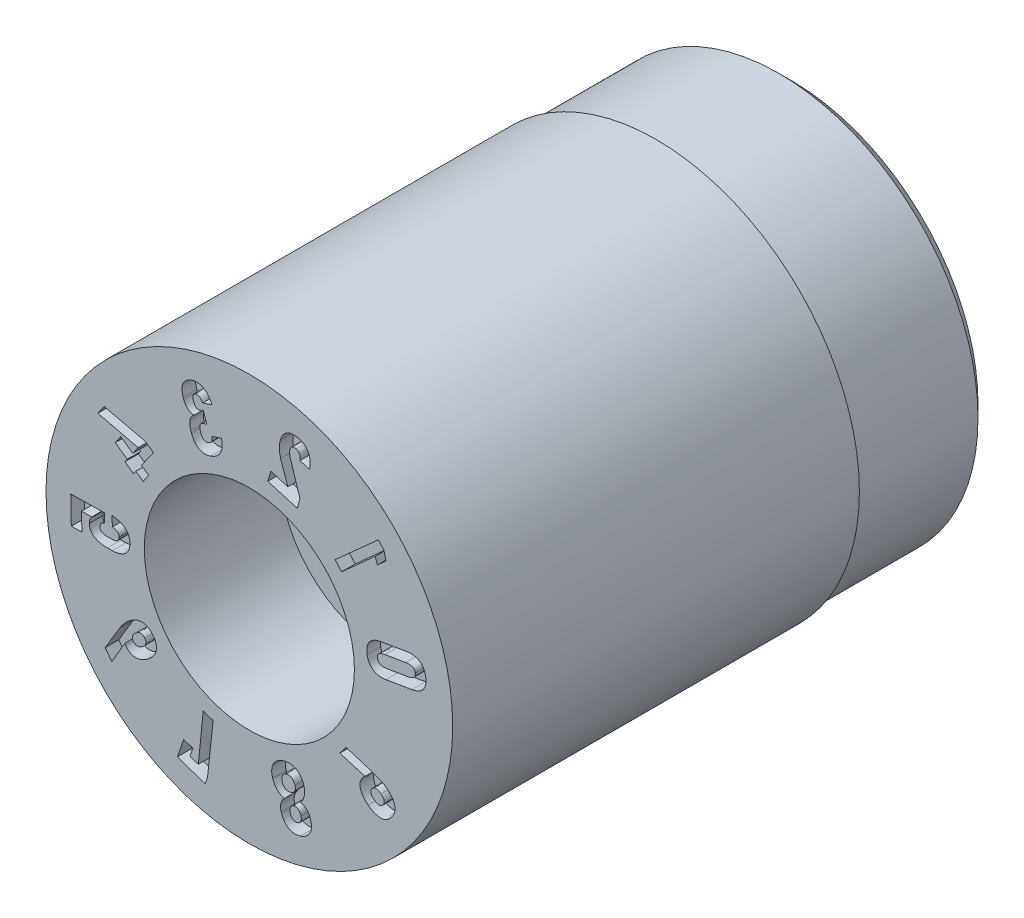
from build123d import *

# Parameters (mm, degrees)
SKETCH4_W          = 2
SKETCH4_H          = 1
CUT_EXTRUDE1_DEPTH = 0.2


with BuildPart() as part:
    # Sketch1 → Revolve1 (revolve)
    with BuildSketch(Plane(origin=(0, 0, 0), x_dir=(0, 0, -1), z_dir=(1, 0, 0)), mode=Mode.PRIVATE) as revolve1_sk:
        Polygon((0, 3), (0, 1.55), (2, 1.55), (2, 0.8), (8, 0.8), (8, 2.75), (7.75, 3), align=None)
    revolve(revolve1_sk.sketch.rotate(Axis((0, 0, 3.797909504), (0, 0, -1)), 90), axis=Axis((0, 0, 3.797909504), (0, 0, -1)))

    # Sketch4 → Cut-Revolve1 (revolve, cut)
    with BuildSketch(Plane(origin=(0, 0, 0), x_dir=(0, 0, -1), z_dir=(1, 0, 0)), mode=Mode.PRIVATE) as cut_revolve1_sk:
        with Locations((7, 3.435)):
            Rectangle(SKETCH4_W, SKETCH4_H)
    revolve(cut_revolve1_sk.sketch.rotate(Axis((0, 0, 0), (0, 0, -1)), 90), axis=Axis((0, 0, 0), (0, 0, -1)), mode=Mode.SUBTRACT)

    # Sketch6 → Cut-Extrude1 (cut)
    # profile 1 of 10: a face of its own
    with BuildSketch(Plane.XY):
        with BuildLine():
            Line((2.014607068, 0.10551883), (2.398508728, 0.169344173))
            add(Edge.make_bspline(
                [(2.398508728, 0.169344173), (2.416406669, 0.172558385), (2.442569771, 0.178085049), (2.475088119, 0.190085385), (2.496970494, 0.200173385), (2.517140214, 0.211589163), (2.535204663, 0.22497844), (2.55164404, 0.239607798), (2.565913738, 0.255949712), (2.578395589, 0.273514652), (2.588310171, 0.292630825), (2.596175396, 0.3129478), (2.601711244, 0.334577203), (2.604982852, 0.357519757), (2.606209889, 0.390669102), (2.603953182, 0.41610249), (2.601027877, 0.433275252)],
                knots=[0, 0, 0, 0, 0.144216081, 0.210853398, 0.274107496, 0.334900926, 0.394019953, 0.451854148, 0.508838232, 0.565473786, 0.62209422, 0.678903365, 0.737673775, 0.798507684, 0.862085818, 1, 1, 1, 1], degree=3))
            add(Edge.make_bspline(
                [(2.601027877, 0.433275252), (2.598176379, 0.450529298), (2.592326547, 0.475467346), (2.580262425, 0.506439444), (2.569649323, 0.526996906), (2.557505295, 0.545788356), (2.543571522, 0.562619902), (2.527858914, 0.577341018), (2.510620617, 0.590095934), (2.491837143, 0.600725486), (2.471733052, 0.609473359), (2.450249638, 0.61603244), (2.427474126, 0.620479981), (2.403380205, 0.622713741), (2.368557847, 0.623256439), (2.341871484, 0.620188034), (2.323795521, 0.617328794)],
                knots=[0, 0, 0, 0, 0.138368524, 0.201729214, 0.262433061, 0.321041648, 0.378364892, 0.434789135, 0.490925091, 0.547560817, 0.605121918, 0.663992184, 0.724855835, 0.788332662, 0.855124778, 1, 1, 1, 1], degree=3))
            Line((2.323795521, 0.617328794), (1.93989386, 0.55350345))
            add(Edge.make_bspline(
                [(1.93989386, 0.55350345), (1.921922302, 0.550550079), (1.895959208, 0.544372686), (1.863299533, 0.532813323), (1.841394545, 0.522709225), (1.821358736, 0.511050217), (1.803243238, 0.497718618), (1.786832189, 0.483061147), (1.772468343, 0.466742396), (1.760249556, 0.449010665), (1.750036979, 0.430014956), (1.742366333, 0.409631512), (1.73702506, 0.388004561), (1.733662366, 0.365150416), (1.73204775, 0.332049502), (1.734920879, 0.306627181), (1.737597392, 0.289463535)],
                knots=[0, 0, 0, 0, 0.144224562, 0.21087119, 0.274141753, 0.33504075, 0.394175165, 0.452024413, 0.509023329, 0.565947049, 0.622265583, 0.679444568, 0.73797653, 0.798414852, 0.862179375, 1, 1, 1, 1], degree=3))
            add(Edge.make_bspline(
                [(1.737597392, 0.289463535), (1.740446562, 0.272209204), (1.746316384, 0.2472149), (1.758401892, 0.216190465), (1.769005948, 0.19554525), (1.781295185, 0.176852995), (1.795472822, 0.160272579), (1.811078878, 0.145380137), (1.828688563, 0.132938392), (1.847612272, 0.122283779), (1.867893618, 0.113597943), (1.889453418, 0.107180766), (1.912137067, 0.102583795), (1.936072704, 0.100308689), (1.970485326, 0.099711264), (1.996840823, 0.102547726), (2.014607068, 0.10551883)],
                knots=[0, 0, 0, 0, 0.138608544, 0.202541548, 0.263350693, 0.322175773, 0.37933296, 0.435855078, 0.492619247, 0.549660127, 0.60766372, 0.667010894, 0.727580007, 0.790746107, 0.857218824, 1, 1, 1, 1], degree=3))
        make_face()
        with BuildLine():
            Line((2.004180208, 0.41918152), (2.306729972, 0.469524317))
            add(Edge.make_bspline(
                [(2.306729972, 0.469524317), (2.324922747, 0.472611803), (2.351137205, 0.474893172), (2.384042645, 0.471767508), (2.401145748, 0.46692035), (2.412983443, 0.461443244), (2.420708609, 0.456379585), (2.427625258, 0.450495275), (2.433693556, 0.443754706), (2.438541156, 0.435943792), (2.44407935, 0.424247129), (2.44675796, 0.414618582), (2.447787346, 0.40789211)],
                knots=[0, 0, 0, 0, 0.317749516, 0.449992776, 0.566883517, 0.621635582, 0.673931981, 0.725321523, 0.777608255, 0.829311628, 0.882944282, 1, 1, 1, 1], degree=3))
            add(Edge.make_bspline(
                [(2.447787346, 0.40789211), (2.44974033, 0.395304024), (2.449970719, 0.375425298), (2.438235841, 0.352785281), (2.425330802, 0.338609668), (2.408184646, 0.326774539), (2.378206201, 0.312860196), (2.352634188, 0.306551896), (2.33438814, 0.303723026)],
                knots=[0, 0, 0, 0, 0.222795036, 0.325269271, 0.432490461, 0.549985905, 0.681672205, 1, 1, 1, 1], degree=3))
            Line((2.33438814, 0.303723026), (2.031838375, 0.253380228))
            add(Edge.make_bspline(
                [(2.031838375, 0.253380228), (2.013674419, 0.250051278), (1.98749062, 0.247906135), (1.954530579, 0.250912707), (1.937461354, 0.255993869), (1.92558179, 0.261455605), (1.917867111, 0.266532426), (1.910975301, 0.272335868), (1.905032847, 0.279163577), (1.900225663, 0.286969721), (1.894648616, 0.298711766), (1.891979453, 0.30834427), (1.89094676, 0.315069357)],
                knots=[0, 0, 0, 0, 0.317529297, 0.44976705, 0.567235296, 0.621985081, 0.674279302, 0.725666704, 0.776639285, 0.829318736, 0.882949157, 1, 1, 1, 1], degree=3))
            add(Edge.make_bspline(
                [(1.89094676, 0.315069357), (1.888938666, 0.327685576), (1.888861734, 0.347442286), (1.900316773, 0.370172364), (1.913250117, 0.384290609), (1.930382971, 0.396121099), (1.960336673, 0.410114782), (1.986045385, 0.41594957), (2.004180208, 0.41918152)],
                knots=[0, 0, 0, 0, 0.222979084, 0.324818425, 0.43212819, 0.549720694, 0.681515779, 1, 1, 1, 1], degree=3))
        make_face(mode=Mode.SUBTRACT)
    # profile 2 of 10: a face of its own
    with BuildSketch(Plane.XY):
        Polygon((1.265939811, 1.262895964), (1.361685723, 1.156386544), (1.857198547, 1.602072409), (1.889825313, 1.50691542), (2.017030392, 1.621417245), (1.984045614, 1.744462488), (1.902313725, 1.835367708), align=None)
    # profile 3 of 10: a face of its own
    with BuildSketch(Plane.XY):
        with BuildLine():
            Line((0.747077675, 1.782271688), (0.60452419, 2.229378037))
            add(Edge.make_bspline(
                [(0.60452419, 2.229378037), (0.598029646, 2.248428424), (0.590905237, 2.285672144), (0.593293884, 2.323589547), (0.598117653, 2.340536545)],
                knots=[0, 0, 0, 0, 0.5342471, 1, 1, 1, 1], degree=3))
            Line((0.598117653, 2.340536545), (0.598482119, 2.341759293))
            add(Edge.make_bspline(
                [(0.598482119, 2.341759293), (0.60115539, 2.351892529), (0.607672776, 2.365898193), (0.620928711, 2.380666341), (0.632532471, 2.388409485), (0.645672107, 2.39330472), (0.666001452, 2.39637324), (0.681866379, 2.393018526), (0.692366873, 2.390166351)],
                knots=[0, 0, 0, 0, 0.261266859, 0.378258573, 0.491228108, 0.605842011, 0.725733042, 1, 1, 1, 1], degree=3))
            add(Edge.make_bspline(
                [(0.692366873, 2.390166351), (0.703130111, 2.387360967), (0.718026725, 2.379575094), (0.733062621, 2.363344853), (0.741143, 2.348590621), (0.746448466, 2.33159353), (0.750026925, 2.304874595), (0.747817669, 2.283751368), (0.745202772, 2.269338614)],
                knots=[0, 0, 0, 0, 0.227548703, 0.335372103, 0.449552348, 0.569520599, 0.698702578, 1, 1, 1, 1], degree=3))
            Line((0.745202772, 2.269338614), (0.886598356, 2.227343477))
            add(Edge.make_bspline(
                [(0.886598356, 2.227343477), (0.892329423, 2.252723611), (0.898144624, 2.289418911), (0.897616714, 2.337570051), (0.893400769, 2.370675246), (0.885645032, 2.401625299), (0.874366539, 2.430090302), (0.8593648, 2.455844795), (0.841167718, 2.479042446), (0.819565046, 2.499241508), (0.78611456, 2.522546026), (0.757338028, 2.534472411), (0.737249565, 2.540322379)],
                knots=[0, 0, 0, 0, 0.196418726, 0.286378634, 0.372567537, 0.454609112, 0.533177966, 0.60915493, 0.684941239, 0.760993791, 0.837616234, 1, 1, 1, 1], degree=3))
            add(Edge.make_bspline(
                [(0.737249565, 2.540322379), (0.715960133, 2.546592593), (0.684012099, 2.552948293), (0.641896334, 2.553511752), (0.612881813, 2.549842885), (0.585691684, 2.542325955), (0.560353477, 2.53120163), (0.537319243, 2.515984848), (0.516366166, 2.497285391), (0.497805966, 2.474886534), (0.475479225, 2.439343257), (0.464034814, 2.408889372), (0.457736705, 2.387705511)],
                knots=[0, 0, 0, 0, 0.183991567, 0.267932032, 0.34800404, 0.425465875, 0.500914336, 0.576306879, 0.65323453, 0.732785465, 0.816526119, 1, 1, 1, 1], degree=3))
            add(Edge.make_bspline(
                [(0.457736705, 2.387705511), (0.452168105, 2.368217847), (0.445835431, 2.339363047), (0.442444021, 2.30000921), (0.442054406, 2.270130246), (0.443397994, 2.240355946), (0.44872544, 2.201737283), (0.455470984, 2.173493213), (0.461611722, 2.155291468)],
                knots=[0, 0, 0, 0, 0.249446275, 0.375438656, 0.503251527, 0.630424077, 0.755229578, 1, 1, 1, 1], degree=3))
            Line((0.461611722, 2.155291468), (0.567049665, 1.845177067))
            Line((0.567049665, 1.845177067), (0.316518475, 1.918144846))
            Line((0.316518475, 1.918144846), (0.27271079, 1.767718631))
            Line((0.27271079, 1.767718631), (0.706091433, 1.641479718))
            Line((0.706091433, 1.641479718), (0.747077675, 1.782271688))
        make_face()
    # profile 4 of 10: a face of its own
    with BuildSketch(Plane.XY):
        with BuildLine():
            Line((-0.414342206, 1.975871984), (-0.55390517, 1.928190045))
            add(Edge.make_bspline(
                [(-0.55390517, 1.928190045), (-0.552299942, 1.919948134), (-0.550413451, 1.907784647), (-0.550687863, 1.891882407), (-0.552036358, 1.880992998), (-0.554525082, 1.870806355), (-0.558253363, 1.861423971), (-0.562984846, 1.852828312), (-0.568724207, 1.844963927), (-0.575642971, 1.838071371), (-0.586412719, 1.830023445), (-0.595779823, 1.825828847), (-0.602244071, 1.823503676)],
                knots=[0, 0, 0, 0, 0.197705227, 0.287545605, 0.372976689, 0.45510037, 0.533273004, 0.609529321, 0.685152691, 0.761272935, 0.838169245, 1, 1, 1, 1], degree=3))
            add(Edge.make_bspline(
                [(-0.602244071, 1.823503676), (-0.613806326, 1.819275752), (-0.631828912, 1.816318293), (-0.655104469, 1.820097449), (-0.670565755, 1.827003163), (-0.684408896, 1.837484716), (-0.701585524, 1.85685417), (-0.709728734, 1.875589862), (-0.714422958, 1.888654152)],
                knots=[0, 0, 0, 0, 0.250747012, 0.363671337, 0.476079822, 0.592197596, 0.715111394, 1, 1, 1, 1], degree=3))
            Line((-0.714422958, 1.888654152), (-0.721005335, 1.907724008))
            add(Edge.make_bspline(
                [(-0.721005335, 1.907724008), (-0.725555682, 1.921531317), (-0.730913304, 1.941684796), (-0.731634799, 1.968016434), (-0.728988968, 1.984646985), (-0.723536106, 1.999299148), (-0.711627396, 2.015836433), (-0.698017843, 2.023481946), (-0.688462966, 2.026774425)],
                knots=[0, 0, 0, 0, 0.314857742, 0.445548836, 0.566052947, 0.676388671, 0.780184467, 1, 1, 1, 1], degree=3))
            Line((-0.688462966, 2.026774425), (-0.627870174, 2.047592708))
            Line((-0.627870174, 2.047592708), (-0.678415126, 2.195137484))
            Line((-0.678415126, 2.195137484), (-0.739007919, 2.174319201))
            add(Edge.make_bspline(
                [(-0.739007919, 2.174319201), (-0.746824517, 2.171419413), (-0.759615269, 2.170184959), (-0.775704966, 2.175392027), (-0.786793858, 2.182698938), (-0.79705479, 2.192960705), (-0.810211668, 2.211443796), (-0.817305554, 2.22798066), (-0.821289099, 2.239811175)],
                knots=[0, 0, 0, 0, 0.211756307, 0.314427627, 0.424926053, 0.546444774, 0.681797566, 1, 1, 1, 1], degree=3))
            Line((-0.821289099, 2.239811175), (-0.826034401, 2.253652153))
            add(Edge.make_bspline(
                [(-0.826034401, 2.253652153), (-0.829836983, 2.264800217), (-0.833971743, 2.281342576), (-0.833787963, 2.302955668), (-0.83079219, 2.316760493), (-0.825467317, 2.328983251), (-0.814365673, 2.342903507), (-0.80235674, 2.349462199), (-0.793828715, 2.352259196)],
                knots=[0, 0, 0, 0, 0.302293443, 0.430969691, 0.549864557, 0.66157451, 0.769289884, 1, 1, 1, 1], degree=3))
            add(Edge.make_bspline(
                [(-0.793828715, 2.352259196), (-0.787960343, 2.354591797), (-0.778587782, 2.355768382), (-0.766017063, 2.355141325), (-0.756612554, 2.352985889), (-0.747298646, 2.349564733), (-0.738153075, 2.34472942), (-0.729310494, 2.33835794), (-0.720587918, 2.330801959), (-0.712111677, 2.321928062), (-0.701202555, 2.307627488), (-0.693984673, 2.295703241), (-0.689504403, 2.28722756)],
                knots=[0, 0, 0, 0, 0.139786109, 0.209269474, 0.280741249, 0.354738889, 0.430797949, 0.511437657, 0.598094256, 0.688760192, 0.78549958, 1, 1, 1, 1], degree=3))
            Line((-0.689504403, 2.28722756), (-0.550325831, 2.334833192))
            add(Edge.make_bspline(
                [(-0.550325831, 2.334833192), (-0.560199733, 2.357520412), (-0.577172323, 2.389784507), (-0.605950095, 2.427318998), (-0.628781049, 2.451252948), (-0.653420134, 2.471175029), (-0.679065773, 2.48762903), (-0.706181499, 2.499570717), (-0.734194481, 2.507673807), (-0.762878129, 2.511658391), (-0.801905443, 2.511639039), (-0.830848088, 2.505510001), (-0.849478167, 2.498950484)],
                knots=[0, 0, 0, 0, 0.196280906, 0.287021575, 0.374088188, 0.457750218, 0.537568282, 0.614827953, 0.691684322, 0.767965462, 0.843529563, 1, 1, 1, 1], degree=3))
            add(Edge.make_bspline(
                [(-0.849478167, 2.498950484), (-0.864475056, 2.493737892), (-0.88597748, 2.484692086), (-0.912147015, 2.469418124), (-0.929266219, 2.45687887), (-0.944335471, 2.442942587), (-0.957564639, 2.427784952), (-0.968994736, 2.411437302), (-0.978198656, 2.393726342), (-0.985463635, 2.375042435), (-0.990523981, 2.355394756), (-0.993668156, 2.334937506), (-0.99439788, 2.313515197), (-0.992988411, 2.291262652), (-0.988636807, 2.259487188), (-0.981862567, 2.235722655), (-0.97633747, 2.219819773)],
                knots=[0, 0, 0, 0, 0.136519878, 0.199806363, 0.260088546, 0.318559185, 0.375879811, 0.432741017, 0.489597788, 0.547043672, 0.604699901, 0.663664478, 0.724620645, 0.788557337, 0.855145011, 1, 1, 1, 1], degree=3))
            Line((-0.97633747, 2.219819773), (-0.967980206, 2.195029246))
            add(Edge.make_bspline(
                [(-0.967980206, 2.195029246), (-0.961787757, 2.177389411), (-0.950231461, 2.152033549), (-0.928161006, 2.123219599), (-0.909645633, 2.104987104), (-0.88895838, 2.090053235), (-0.858579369, 2.074624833), (-0.833453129, 2.068705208), (-0.8163712, 2.067307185)],
                knots=[0, 0, 0, 0, 0.267258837, 0.393105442, 0.515918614, 0.636695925, 0.755618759, 1, 1, 1, 1], degree=3))
            add(Edge.make_bspline(
                [(-0.8163712, 2.067307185), (-0.823893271, 2.062174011), (-0.834706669, 2.0538071), (-0.846794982, 2.040366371), (-0.854947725, 2.029790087), (-0.861692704, 2.01813812), (-0.86734514, 2.005749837), (-0.872058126, 1.992520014), (-0.875550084, 1.978486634), (-0.877841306, 1.963780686), (-0.87922519, 1.948533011), (-0.879098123, 1.93275543), (-0.878053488, 1.916425), (-0.875802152, 1.899573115), (-0.871093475, 1.875950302), (-0.86580547, 1.858299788), (-0.861786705, 1.846455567)],
                knots=[0, 0, 0, 0, 0.112274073, 0.166991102, 0.222093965, 0.276289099, 0.332234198, 0.389462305, 0.448852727, 0.509882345, 0.572454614, 0.637014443, 0.703804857, 0.773710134, 0.846042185, 1, 1, 1, 1], degree=3))
            Line((-0.861786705, 1.846455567), (-0.853290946, 1.821772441))
            add(Edge.make_bspline(
                [(-0.853290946, 1.821772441), (-0.84583036, 1.799721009), (-0.832102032, 1.768584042), (-0.807921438, 1.731822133), (-0.78798204, 1.708943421), (-0.76608998, 1.689742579), (-0.742185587, 1.674466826), (-0.71634137, 1.663472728), (-0.688869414, 1.656341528), (-0.659860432, 1.653345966), (-0.618211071, 1.655215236), (-0.586889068, 1.662616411), (-0.566218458, 1.669800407)],
                knots=[0, 0, 0, 0, 0.189179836, 0.274846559, 0.356631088, 0.435016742, 0.510693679, 0.586123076, 0.662270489, 0.740496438, 0.822165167, 1, 1, 1, 1], degree=3))
            add(Edge.make_bspline(
                [(-0.566218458, 1.669800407), (-0.545622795, 1.67697208), (-0.516043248, 1.690302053), (-0.481451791, 1.71492213), (-0.459159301, 1.73578158), (-0.440010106, 1.758993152), (-0.424611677, 1.78463594), (-0.4127481, 1.812424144), (-0.404788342, 1.842318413), (-0.400652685, 1.873931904), (-0.400954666, 1.919170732), (-0.40762242, 1.953282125), (-0.414342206, 1.975871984)],
                knots=[0, 0, 0, 0, 0.171218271, 0.252380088, 0.331984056, 0.410009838, 0.487610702, 0.565757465, 0.646215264, 0.729479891, 0.815075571, 1, 1, 1, 1], degree=3))
        make_face()
    # profile 5 of 10: a face of its own
    with BuildSketch(Plane.XY):
        Polygon((-1.537457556, 1.375883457), (-2.142875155, 1.515341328), (-2.235814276, 1.383003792), (-1.639740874, 1.242579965), (-1.719161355, 1.129489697), (-1.896452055, 1.253861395), (-1.978538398, 1.136833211), (-1.80131445, 1.01250834), (-1.835452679, 0.963897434), (-1.708203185, 0.874705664), (-1.674096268, 0.923263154), (-1.566171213, 0.847552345), (-1.48408487, 0.964580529), (-1.591933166, 1.040237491), (-1.415969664, 1.290754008), align=None)
    # profile 6 of 10: a face of its own
    with BuildSketch(Plane.XY):
        with BuildLine():
            Line((-2.023920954, 0.180548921), (-2.021528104, 0.038039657))
            add(Edge.make_bspline(
                [(-2.021528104, 0.038039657), (-2.006708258, 0.03708704), (-1.986276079, 0.033755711), (-1.961673, 0.023986), (-1.946859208, 0.014583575), (-1.934657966, 0.003349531), (-1.92305135, -0.014727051), (-1.919181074, -0.030496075), (-1.919314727, -0.041223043)],
                knots=[0, 0, 0, 0, 0.301164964, 0.430720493, 0.553236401, 0.66775825, 0.776114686, 1, 1, 1, 1], degree=3))
            add(Edge.make_bspline(
                [(-1.919314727, -0.041223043), (-1.919086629, -0.052497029), (-1.921677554, -0.069555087), (-1.93342349, -0.088755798), (-1.945812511, -0.100421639), (-1.961208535, -0.109794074), (-1.987168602, -0.119626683), (-2.009079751, -0.121378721), (-2.02419603, -0.122044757)],
                knots=[0, 0, 0, 0, 0.227495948, 0.334814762, 0.446114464, 0.565812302, 0.694478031, 1, 1, 1, 1], degree=3))
            Line((-2.02419603, -0.122044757), (-2.096231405, -0.123448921))
            add(Edge.make_bspline(
                [(-2.096231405, -0.123448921), (-2.111377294, -0.12396544), (-2.133028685, -0.122477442), (-2.15939346, -0.115078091), (-2.175084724, -0.107286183), (-2.18768157, -0.09730075), (-2.200064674, -0.08077076), (-2.20367711, -0.065490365), (-2.203773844, -0.055282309)],
                knots=[0, 0, 0, 0, 0.317974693, 0.451282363, 0.571973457, 0.683103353, 0.785410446, 1, 1, 1, 1], degree=3))
            add(Edge.make_bspline(
                [(-2.203773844, -0.055282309), (-2.204124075, -0.045669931), (-2.202116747, -0.031449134), (-2.19499885, -0.013957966), (-2.187250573, -0.002397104), (-2.177723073, 0.007957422), (-2.161634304, 0.019359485), (-2.147975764, 0.025739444), (-2.137940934, 0.028132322)],
                knots=[0, 0, 0, 0, 0.249817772, 0.368942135, 0.488860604, 0.610437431, 0.733236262, 1, 1, 1, 1], degree=3))
            Line((-2.137940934, 0.028132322), (-2.140649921, 0.161331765))
            Line((-2.140649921, 0.161331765), (-2.635062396, 0.151208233))
            Line((-2.635062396, 0.151208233), (-2.626827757, -0.255226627))
            Line((-2.626827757, -0.255226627), (-2.470674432, -0.251917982))
            Line((-2.470674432, -0.251917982), (-2.475990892, 0.012029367))
            Line((-2.475990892, 0.012029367), (-2.324040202, 0.015163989))
            add(Edge.make_bspline(
                [(-2.324040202, 0.015163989), (-2.330134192, 0.009484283), (-2.337962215, -0.000738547), (-2.346276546, -0.016279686), (-2.356723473, -0.042466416), (-2.360693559, -0.066212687), (-2.360408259, -0.085097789)],
                knots=[0, 0, 0, 0, 0.227728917, 0.350588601, 0.482559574, 1, 1, 1, 1], degree=3))
            add(Edge.make_bspline(
                [(-2.360408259, -0.085097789), (-2.359777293, -0.103473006), (-2.356273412, -0.130767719), (-2.342193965, -0.163738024), (-2.328160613, -0.185705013), (-2.310391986, -0.205255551), (-2.288913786, -0.222084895), (-2.264122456, -0.236370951), (-2.235837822, -0.247734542), (-2.204457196, -0.256501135), (-2.156849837, -0.26530914), (-2.119147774, -0.266102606), (-2.093313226, -0.265936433)],
                knots=[0, 0, 0, 0, 0.152216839, 0.223263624, 0.294076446, 0.366246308, 0.440030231, 0.518215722, 0.601427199, 0.690703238, 0.786539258, 1, 1, 1, 1], degree=3))
            Line((-2.093313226, -0.265936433), (-2.021277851, -0.264532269))
            add(Edge.make_bspline(
                [(-2.021277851, -0.264532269), (-1.995426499, -0.263782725), (-1.957717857, -0.260610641), (-1.910534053, -0.248350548), (-1.879543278, -0.236133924), (-1.85171758, -0.221062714), (-1.8274736, -0.202715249), (-1.806822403, -0.181487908), (-1.789971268, -0.15735103), (-1.776733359, -0.130644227), (-1.764151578, -0.090364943), (-1.761554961, -0.057949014), (-1.762015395, -0.035937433)],
                knots=[0, 0, 0, 0, 0.198210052, 0.287930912, 0.372209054, 0.452593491, 0.529370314, 0.6040095, 0.678325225, 0.753762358, 0.8312713, 1, 1, 1, 1], degree=3))
            add(Edge.make_bspline(
                [(-1.762015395, -0.035937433), (-1.762408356, -0.016476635), (-1.76633215, 0.012577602), (-1.780385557, 0.048487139), (-1.794222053, 0.073485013), (-1.811727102, 0.096391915), (-1.832933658, 0.116803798), (-1.857481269, 0.134721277), (-1.885259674, 0.150118), (-1.91610913, 0.162411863), (-1.96210279, 0.175534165), (-1.998840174, 0.179459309), (-2.023920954, 0.180548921)],
                knots=[0, 0, 0, 0, 0.154697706, 0.22960265, 0.304852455, 0.380725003, 0.457448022, 0.537585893, 0.621217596, 0.708760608, 0.800521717, 1, 1, 1, 1], degree=3))
        make_face()
    # profile 7 of 10: a face of its own
    with BuildSketch(Plane.XY):
        with BuildLine():
            Line((-1.920291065, -1.211932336), (-2.126478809, -1.557062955))
            Line((-2.126478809, -1.557062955), (-2.029859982, -1.687723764))
            Line((-2.029859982, -1.687723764), (-1.835848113, -1.356532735))
            add(Edge.make_bspline(
                [(-1.835848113, -1.356532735), (-1.832058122, -1.365173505), (-1.827195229, -1.373348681), (-1.821645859, -1.380961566)],
                knots=[0.764170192, 0.764170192, 0.764170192, 0.764170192, 1, 1, 1, 1], degree=3))
            add(Edge.make_bspline(
                [(-1.821645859, -1.380961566), (-1.809772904, -1.39662236), (-1.790087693, -1.418224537), (-1.75838103, -1.439105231), (-1.733617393, -1.450215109), (-1.707366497, -1.45711144), (-1.679869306, -1.459655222), (-1.651179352, -1.458188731), (-1.621489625, -1.452167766), (-1.590917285, -1.442165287), (-1.547824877, -1.422502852), (-1.516864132, -1.402723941), (-1.496597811, -1.387687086)],
                knots=[0, 0, 0, 0, 0.160701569, 0.235164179, 0.308132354, 0.381069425, 0.455431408, 0.532430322, 0.614474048, 0.701692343, 0.794182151, 1, 1, 1, 1], degree=3))
            add(Edge.make_bspline(
                [(-1.496597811, -1.387687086), (-1.475473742, -1.371910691), (-1.446863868, -1.347450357), (-1.415515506, -1.310295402), (-1.397226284, -1.282471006), (-1.383202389, -1.254056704), (-1.373926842, -1.225188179), (-1.36943876, -1.195931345), (-1.369756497, -1.166494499), (-1.374532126, -1.136969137), (-1.387953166, -1.096872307), (-1.404345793, -1.068782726), (-1.41764806, -1.051160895)],
                knots=[0, 0, 0, 0, 0.197264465, 0.286684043, 0.371499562, 0.451680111, 0.528643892, 0.602804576, 0.677381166, 0.75321951, 0.83092882, 1, 1, 1, 1], degree=3))
            add(Edge.make_bspline(
                [(-1.41764806, -1.051160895), (-1.4308524, -1.033710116), (-1.452380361, -1.009422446), (-1.486801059, -0.98520557), (-1.513417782, -0.971834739), (-1.541309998, -0.962927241), (-1.570407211, -0.95851639), (-1.600470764, -0.958879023), (-1.631476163, -0.963523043), (-1.663090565, -0.97267602), (-1.707236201, -0.991847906), (-1.738913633, -1.011483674), (-1.759329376, -1.026894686)],
                knots=[0, 0, 0, 0, 0.169313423, 0.247571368, 0.32345525, 0.398287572, 0.472554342, 0.549541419, 0.629386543, 0.713780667, 0.80271958, 1, 1, 1, 1], degree=3))
            add(Edge.make_bspline(
                [(-1.759329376, -1.026894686), (-1.772817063, -1.036601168), (-1.791570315, -1.05250081), (-1.815698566, -1.0754091), (-1.852635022, -1.114182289), (-1.880341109, -1.149953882), (-1.900527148, -1.180218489)],
                knots=[0, 0, 0, 0, 0.231348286, 0.352666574, 0.477588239, 1, 1, 1, 1], degree=3))
            add(Edge.make_bspline(
                [(-1.900527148, -1.180218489), (-1.903901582, -1.185565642), (-1.911001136, -1.195815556), (-1.917212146, -1.20662793), (-1.920291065, -1.211932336)],
                knots=[0, 0, 0, 0, 0.507542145, 1, 1, 1, 1], degree=3))
        make_face()
        with BuildLine():
            add(Edge.make_bspline(
                [(-1.543406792, -1.144329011), (-1.536213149, -1.153415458), (-1.528598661, -1.168846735), (-1.525761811, -1.191018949), (-1.528078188, -1.207070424), (-1.533816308, -1.222962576), (-1.547752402, -1.244181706), (-1.562408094, -1.257684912), (-1.573535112, -1.265785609)],
                knots=[0, 0, 0, 0, 0.244263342, 0.354807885, 0.467434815, 0.583630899, 0.709107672, 1, 1, 1, 1], degree=3))
            add(Edge.make_bspline(
                [(-1.573535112, -1.265785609), (-1.586686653, -1.275752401), (-1.606175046, -1.287499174), (-1.633454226, -1.296923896), (-1.65194507, -1.299081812), (-1.669284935, -1.297649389), (-1.690771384, -1.289377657), (-1.703771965, -1.277527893), (-1.710579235, -1.268096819)],
                knots=[0, 0, 0, 0, 0.308467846, 0.438930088, 0.557953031, 0.667997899, 0.773853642, 1, 1, 1, 1], degree=3))
            add(Edge.make_bspline(
                [(-1.710579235, -1.268096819), (-1.717221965, -1.258849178), (-1.725222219, -1.243124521), (-1.726044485, -1.22014), (-1.72231676, -1.203022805), (-1.714629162, -1.185888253), (-1.697600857, -1.162673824), (-1.680972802, -1.147319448), (-1.668137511, -1.138122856)],
                knots=[0, 0, 0, 0, 0.2238851, 0.330037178, 0.442005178, 0.562380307, 0.692983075, 1, 1, 1, 1], degree=3))
            add(Edge.make_bspline(
                [(-1.668137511, -1.138122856), (-1.656514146, -1.129691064), (-1.639509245, -1.119241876), (-1.615144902, -1.112503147), (-1.598415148, -1.111548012), (-1.58257052, -1.114310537), (-1.562272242, -1.123094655), (-1.550217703, -1.135263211), (-1.543406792, -1.144329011)],
                knots=[0, 0, 0, 0, 0.293386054, 0.417879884, 0.534255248, 0.646942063, 0.757014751, 1, 1, 1, 1], degree=3))
        make_face(mode=Mode.SUBTRACT)
    # profile 8 of 10: a face of its own
    with BuildSketch(Plane.XY):
        Polygon((-0.617058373, -2.457992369), (-0.534527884, -1.692756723), (-0.680869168, -1.642805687), (-0.752515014, -2.360416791), (-0.875620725, -2.318230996), (-0.83383203, -2.195925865), (-0.968940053, -2.149781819), (-1.061291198, -2.419506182), (-0.651888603, -2.559539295), align=None)
    # profile 9 of 10: a face of its own
    with BuildSketch(Plane.XY):
        with BuildLine():
            Line((0.342157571, -1.98365176), (0.34621137, -1.997139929))
            add(Edge.make_bspline(
                [(0.34621137, -1.997139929), (0.352134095, -2.01727441), (0.365107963, -2.046139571), (0.388923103, -2.080882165), (0.410319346, -2.104177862), (0.433833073, -2.124749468), (0.467743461, -2.146763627), (0.495710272, -2.157893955), (0.515099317, -2.161880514)],
                knots=[0, 0, 0, 0, 0.254577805, 0.38167646, 0.510288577, 0.637927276, 0.76031573, 1, 1, 1, 1], degree=3))
            add(Edge.make_bspline(
                [(0.515099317, -2.161880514), (0.503505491, -2.173977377), (0.487731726, -2.194147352), (0.473792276, -2.22523955), (0.466039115, -2.249977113), (0.461337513, -2.275550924), (0.459719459, -2.309842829), (0.463505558, -2.335322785), (0.468553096, -2.351575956)],
                knots=[0, 0, 0, 0, 0.246336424, 0.370671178, 0.497932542, 0.625803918, 0.750909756, 1, 1, 1, 1], degree=3))
            Line((0.468553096, -2.351575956), (0.474990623, -2.373147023))
            add(Edge.make_bspline(
                [(0.474990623, -2.373147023), (0.480975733, -2.393454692), (0.493006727, -2.422439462), (0.515678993, -2.456542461), (0.534906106, -2.47858277), (0.556710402, -2.497161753), (0.580390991, -2.512447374), (0.606163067, -2.523997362), (0.633623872, -2.531891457), (0.662529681, -2.536070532), (0.703404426, -2.536218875), (0.73412611, -2.530065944), (0.754398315, -2.524089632)],
                knots=[0, 0, 0, 0, 0.177662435, 0.260975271, 0.342618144, 0.422185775, 0.500506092, 0.578272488, 0.658218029, 0.739450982, 0.822498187, 1, 1, 1, 1], degree=3))
            add(Edge.make_bspline(
                [(0.754398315, -2.524089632), (0.77471033, -2.518108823), (0.803682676, -2.506065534), (0.837756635, -2.483444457), (0.859708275, -2.464213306), (0.878245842, -2.442579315), (0.893312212, -2.418790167), (0.904842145, -2.393089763), (0.912617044, -2.365508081), (0.916705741, -2.336537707), (0.916608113, -2.29555846), (0.910944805, -2.264711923), (0.904759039, -2.24443553)],
                knots=[0, 0, 0, 0, 0.177676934, 0.26099657, 0.34216072, 0.421734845, 0.499167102, 0.577616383, 0.657196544, 0.738803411, 0.822265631, 1, 1, 1, 1], degree=3))
            Line((0.904759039, -2.24443553), (0.898321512, -2.222864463))
            add(Edge.make_bspline(
                [(0.898321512, -2.222864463), (0.893375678, -2.206321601), (0.882639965, -2.18260124), (0.862271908, -2.154565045), (0.844003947, -2.135956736), (0.823765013, -2.119605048), (0.794482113, -2.102017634), (0.770305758, -2.093666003), (0.753794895, -2.090346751)],
                knots=[0, 0, 0, 0, 0.251562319, 0.376086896, 0.503572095, 0.630735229, 0.754573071, 1, 1, 1, 1], degree=3))
            add(Edge.make_bspline(
                [(0.753794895, -2.090346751), (0.767545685, -2.075962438), (0.785527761, -2.051458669), (0.801830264, -2.014203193), (0.810650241, -1.984129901), (0.81565848, -1.952952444), (0.817367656, -1.910901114), (0.811611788, -1.879750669), (0.805876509, -1.859657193)],
                knots=[0, 0, 0, 0, 0.241288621, 0.364267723, 0.491404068, 0.620225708, 0.74619083, 1, 1, 1, 1], degree=3))
            Line((0.805876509, -1.859657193), (0.80182271, -1.846169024))
            add(Edge.make_bspline(
                [(0.80182271, -1.846169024), (0.795680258, -1.824487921), (0.782501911, -1.793997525), (0.758936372, -1.757550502), (0.738320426, -1.734407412), (0.715256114, -1.714615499), (0.689925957, -1.69855955), (0.66248167, -1.68633205), (0.633085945, -1.678234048), (0.602112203, -1.673977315), (0.55833558, -1.674201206), (0.525400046, -1.68032602), (0.503748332, -1.686952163)],
                knots=[0, 0, 0, 0, 0.177147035, 0.259976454, 0.340867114, 0.420383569, 0.498645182, 0.576254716, 0.656165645, 0.73802431, 0.821748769, 1, 1, 1, 1], degree=3))
            add(Edge.make_bspline(
                [(0.503748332, -1.686952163), (0.482096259, -1.693407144), (0.451048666, -1.706084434), (0.414654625, -1.730271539), (0.391217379, -1.75078874), (0.371000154, -1.773570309), (0.354890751, -1.798896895), (0.342441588, -1.826137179), (0.334096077, -1.855321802), (0.329722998, -1.886036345), (0.32926377, -1.92948336), (0.335808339, -1.962159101), (0.342157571, -1.98365176)],
                knots=[0, 0, 0, 0, 0.178256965, 0.262078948, 0.343430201, 0.423207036, 0.50134654, 0.579163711, 0.658540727, 0.739777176, 0.823060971, 1, 1, 1, 1], degree=3))
        make_face()
        with BuildLine():
            Line((0.672107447, -1.909534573), (0.674394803, -1.917471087))
            add(Edge.make_bspline(
                [(0.674394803, -1.917471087), (0.677023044, -1.926180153), (0.679535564, -1.939445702), (0.679448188, -1.957070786), (0.677512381, -1.969548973), (0.673885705, -1.981336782), (0.668995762, -1.992504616), (0.662388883, -2.002720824), (0.65432318, -2.012030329), (0.64491182, -2.020358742), (0.630087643, -2.029964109), (0.617675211, -2.035309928), (0.608854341, -2.037837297)],
                knots=[0, 0, 0, 0, 0.176989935, 0.260517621, 0.341780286, 0.42166443, 0.499849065, 0.578198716, 0.657343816, 0.738828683, 0.821790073, 1, 1, 1, 1], degree=3))
            add(Edge.make_bspline(
                [(0.608854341, -2.037837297), (0.600109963, -2.040622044), (0.586821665, -2.042940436), (0.569127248, -2.043163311), (0.556652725, -2.041235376), (0.544650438, -2.038003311), (0.533545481, -2.032841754), (0.523191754, -2.026269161), (0.513886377, -2.018005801), (0.505329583, -2.008654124), (0.495456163, -1.993978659), (0.490277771, -1.981527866), (0.487756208, -1.972778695)],
                knots=[0, 0, 0, 0, 0.177455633, 0.260073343, 0.341903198, 0.421387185, 0.500263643, 0.578347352, 0.658314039, 0.740807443, 0.823494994, 1, 1, 1, 1], degree=3))
            Line((0.487756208, -1.972778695), (0.485229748, -1.96416027))
            add(Edge.make_bspline(
                [(0.485229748, -1.96416027), (0.48238237, -1.95473806), (0.479696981, -1.940506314), (0.47924534, -1.921530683), (0.480978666, -1.908134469), (0.48399863, -1.895308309), (0.488874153, -1.883367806), (0.495519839, -1.872518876), (0.503484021, -1.862565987), (0.512944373, -1.853944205), (0.527205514, -1.843511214), (0.539746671, -1.838410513), (0.548386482, -1.835711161)],
                knots=[0, 0, 0, 0, 0.18345104, 0.268710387, 0.35299595, 0.434741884, 0.513941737, 0.592425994, 0.671355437, 0.750906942, 0.830533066, 1, 1, 1, 1], degree=3))
            add(Edge.make_bspline(
                [(0.548386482, -1.835711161), (0.557071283, -1.833157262), (0.570360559, -1.830589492), (0.588098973, -1.831297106), (0.600760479, -1.833695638), (0.612962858, -1.837655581), (0.624338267, -1.843558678), (0.635128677, -1.850759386), (0.644755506, -1.859877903), (0.653630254, -1.870236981), (0.663483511, -1.886647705), (0.669573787, -1.89992099), (0.672107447, -1.909534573)],
                knots=[0, 0, 0, 0, 0.168152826, 0.248104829, 0.327770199, 0.406427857, 0.485018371, 0.564669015, 0.64610389, 0.730070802, 0.816746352, 1, 1, 1, 1], degree=3))
        make_face(mode=Mode.SUBTRACT)
        with BuildLine():
            Line((0.7598277, -2.257597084), (0.762115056, -2.265533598))
            add(Edge.make_bspline(
                [(0.762115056, -2.265533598), (0.764462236, -2.27370358), (0.767276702, -2.285974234), (0.767495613, -2.302301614), (0.766506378, -2.313721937), (0.763929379, -2.324591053), (0.759720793, -2.334559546), (0.75468139, -2.34402965), (0.748080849, -2.352528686), (0.740159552, -2.360051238), (0.727817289, -2.368729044), (0.717172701, -2.373164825), (0.709760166, -2.375330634)],
                knots=[0, 0, 0, 0, 0.18658772, 0.272772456, 0.356426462, 0.436924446, 0.515998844, 0.592627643, 0.671058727, 0.750298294, 0.830877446, 1, 1, 1, 1], degree=3))
            add(Edge.make_bspline(
                [(0.709760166, -2.375330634), (0.702381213, -2.377722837), (0.691050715, -2.379555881), (0.676067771, -2.379173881), (0.66543695, -2.377188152), (0.655236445, -2.373880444), (0.645624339, -2.368940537), (0.636788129, -2.362504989), (0.628687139, -2.354701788), (0.621558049, -2.345576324), (0.612616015, -2.331820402), (0.608227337, -2.319973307), (0.605665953, -2.311877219)],
                knots=[0, 0, 0, 0, 0.168996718, 0.248665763, 0.326294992, 0.404426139, 0.482149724, 0.561316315, 0.642433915, 0.727011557, 0.813803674, 1, 1, 1, 1], degree=3))
            Line((0.605665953, -2.311877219), (0.603089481, -2.303501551))
            add(Edge.make_bspline(
                [(0.603089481, -2.303501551), (0.600464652, -2.29491187), (0.597917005, -2.281959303), (0.597136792, -2.264757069), (0.598309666, -2.252701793), (0.600570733, -2.241226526), (0.604336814, -2.230570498), (0.609231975, -2.220597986), (0.615801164, -2.211757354), (0.623545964, -2.203890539), (0.63563577, -2.194733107), (0.646337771, -2.190230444), (0.653727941, -2.187910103)],
                knots=[0, 0, 0, 0, 0.190008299, 0.278270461, 0.363668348, 0.445898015, 0.52532529, 0.602355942, 0.680255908, 0.757415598, 0.835511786, 1, 1, 1, 1], degree=3))
            add(Edge.make_bspline(
                [(0.653727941, -2.187910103), (0.66118651, -2.185637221), (0.672571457, -2.183868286), (0.687712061, -2.184587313), (0.698475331, -2.187013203), (0.708807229, -2.190820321), (0.718389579, -2.19644188), (0.727559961, -2.20314489), (0.73578203, -2.211701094), (0.74323453, -2.221435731), (0.752184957, -2.236435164), (0.75712729, -2.248892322), (0.7598277, -2.257597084)],
                knots=[0, 0, 0, 0, 0.163774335, 0.240232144, 0.317593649, 0.395042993, 0.470905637, 0.550614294, 0.633300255, 0.719563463, 0.808142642, 1, 1, 1, 1], degree=3))
        make_face(mode=Mode.SUBTRACT)
    # profile 10 of 10: a face of its own
    with BuildSketch(Plane.XY):
        with BuildLine():
            Line((1.803654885, -1.171738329), (1.426975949, -1.054024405))
            Line((1.426975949, -1.054024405), (1.333994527, -1.174706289))
            Line((1.333994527, -1.174706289), (1.707063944, -1.284691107))
            add(Edge.make_bspline(
                [(1.707063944, -1.284691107), (1.706476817, -1.285076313), (1.701514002, -1.28839445), (1.687822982, -1.299018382), (1.676612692, -1.311397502), (1.669648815, -1.320314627)],
                knots=[0.575604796, 0.575604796, 0.575604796, 0.575604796, 0.592823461, 0.721986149, 1, 1, 1, 1], degree=3))
            add(Edge.make_bspline(
                [(1.669648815, -1.320314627), (1.658239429, -1.334728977), (1.644804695, -1.358686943), (1.634945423, -1.393474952), (1.632053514, -1.420112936), (1.633302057, -1.447297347), (1.63849652, -1.47462433), (1.648077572, -1.501833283), (1.661461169, -1.528895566), (1.678662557, -1.555514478), (1.707593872, -1.59047899), (1.733480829, -1.613861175), (1.752244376, -1.628410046)],
                knots=[0, 0, 0, 0, 0.154176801, 0.227628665, 0.302334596, 0.378161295, 0.455371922, 0.535064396, 0.61963444, 0.708374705, 0.800579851, 1, 1, 1, 1], degree=3))
            add(Edge.make_bspline(
                [(1.752244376, -1.628410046), (1.773541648, -1.644590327), (1.805100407, -1.665706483), (1.849724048, -1.685856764), (1.881577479, -1.695861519), (1.912765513, -1.701386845), (1.9431279, -1.702512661), (1.972557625, -1.698718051), (2.000941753, -1.690454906), (2.028093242, -1.677835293), (2.063083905, -1.65401385), (2.085425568, -1.630312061), (2.098919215, -1.612837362)],
                knots=[0, 0, 0, 0, 0.198698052, 0.288099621, 0.372832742, 0.452826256, 0.529135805, 0.60379036, 0.678264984, 0.753910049, 0.831316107, 1, 1, 1, 1], degree=3))
            add(Edge.make_bspline(
                [(2.098919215, -1.612837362), (2.112482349, -1.595525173), (2.129233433, -1.567701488), (2.143200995, -1.52783637), (2.148363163, -1.498286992), (2.148807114, -1.468670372), (2.144386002, -1.439182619), (2.135491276, -1.409840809), (2.121854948, -1.380833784), (2.103712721, -1.352412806), (2.072409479, -1.314326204), (2.044191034, -1.288616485), (2.023284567, -1.272806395)],
                knots=[0, 0, 0, 0, 0.167032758, 0.244469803, 0.319743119, 0.39394742, 0.468554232, 0.545392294, 0.626107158, 0.711320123, 0.800919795, 1, 1, 1, 1], degree=3))
            add(Edge.make_bspline(
                [(2.023284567, -1.272806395), (2.010773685, -1.263184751), (1.991528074, -1.250339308), (1.964039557, -1.23503601), (1.941592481, -1.22359191), (1.917417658, -1.213127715), (1.882720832, -1.198375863), (1.855395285, -1.188780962), (1.836745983, -1.1823819)],
                knots=[0, 0, 0, 0, 0.217460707, 0.33395844, 0.454836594, 0.581624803, 0.714771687, 1, 1, 1, 1], degree=3))
            add(Edge.make_bspline(
                [(1.836745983, -1.1823819), (1.831248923, -1.180529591), (1.820438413, -1.176316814), (1.80927755, -1.17312518), (1.803654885, -1.171738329)],
                knots=[0, 0, 0, 0, 0.500377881, 1, 1, 1, 1], degree=3))
        make_face()
        with BuildLine():
            add(Edge.make_bspline(
                [(1.808497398, -1.38945461), (1.815441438, -1.380317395), (1.828444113, -1.368777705), (1.8496819, -1.360752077), (1.866680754, -1.359195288), (1.884500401, -1.361627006), (1.910688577, -1.370207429), (1.928913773, -1.382189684), (1.940942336, -1.391217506)],
                knots=[0, 0, 0, 0, 0.230373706, 0.338670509, 0.450189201, 0.568972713, 0.697014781, 1, 1, 1, 1], degree=3))
            add(Edge.make_bspline(
                [(1.940942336, -1.391217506), (1.952820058, -1.400513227), (1.968409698, -1.414621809), (1.982577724, -1.437115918), (1.988933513, -1.453416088), (1.991030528, -1.469907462), (1.988937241, -1.49221784), (1.980467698, -1.507427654), (1.973513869, -1.516392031)],
                knots=[0, 0, 0, 0, 0.298630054, 0.425573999, 0.54393711, 0.655415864, 0.76454523, 1, 1, 1, 1], degree=3))
            add(Edge.make_bspline(
                [(1.973513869, -1.516392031), (1.966722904, -1.525856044), (1.953702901, -1.537402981), (1.93265272, -1.545708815), (1.916052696, -1.54755978), (1.898532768, -1.545598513), (1.873088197, -1.537475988), (1.855333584, -1.52608966), (1.843784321, -1.517355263)],
                knots=[0, 0, 0, 0, 0.237456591, 0.345518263, 0.457578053, 0.575041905, 0.703180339, 1, 1, 1, 1], degree=3))
            add(Edge.make_bspline(
                [(1.843784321, -1.517355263), (1.831361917, -1.507844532), (1.815584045, -1.493068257), (1.800289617, -1.470259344), (1.793852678, -1.453533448), (1.791064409, -1.43684649), (1.793424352, -1.414199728), (1.801209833, -1.39854085), (1.808497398, -1.38945461)],
                knots=[0, 0, 0, 0, 0.301578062, 0.429916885, 0.547918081, 0.658796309, 0.766425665, 1, 1, 1, 1], degree=3))
        make_face(mode=Mode.SUBTRACT)
    extrude(amount=-CUT_EXTRUDE1_DEPTH, mode=Mode.SUBTRACT)


solid = part.part
